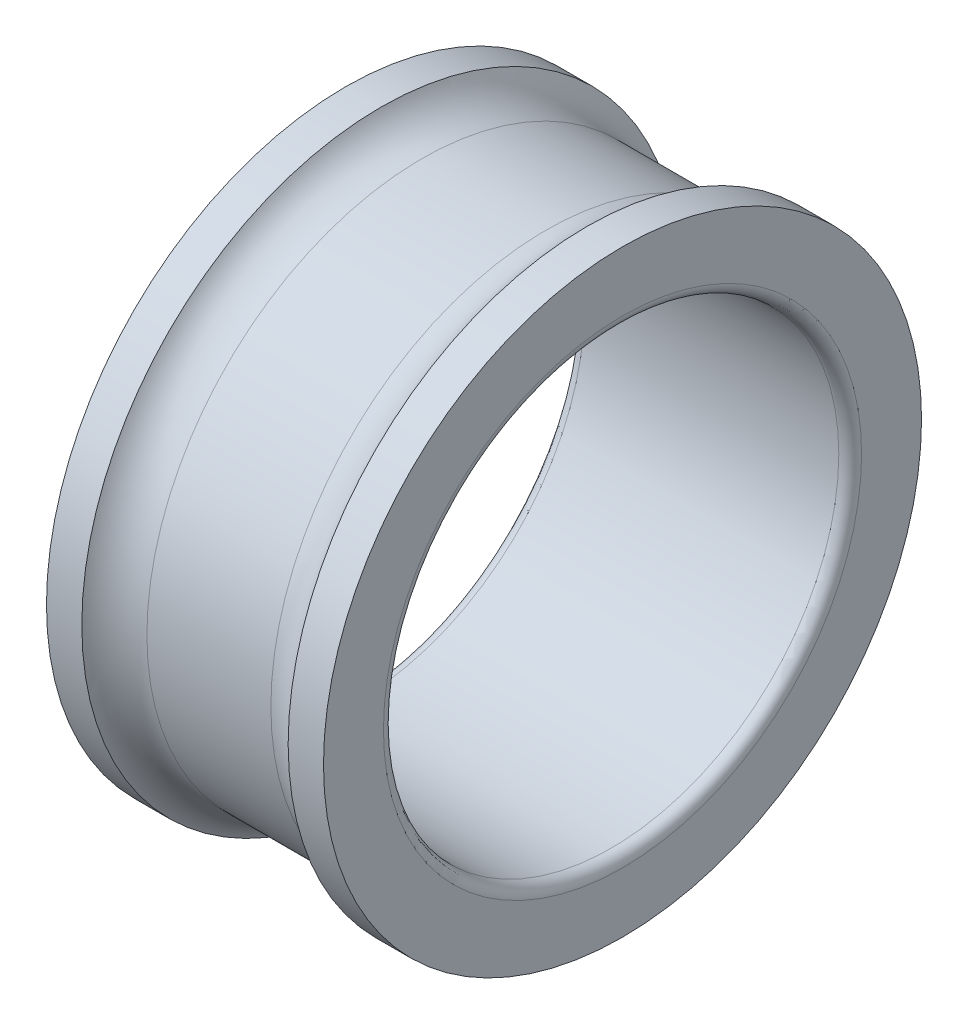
ISO-10303-21;
HEADER;
FILE_DESCRIPTION(('STEP AP214'),'2;1');
FILE_NAME('part.step','',(''),(''),'','','');
FILE_SCHEMA(('AUTOMOTIVE_DESIGN { 1 0 10303 214 1 1 1 1 }'));
ENDSEC;
DATA;
#1=APPLICATION_CONTEXT('core data for automotive mechanical design processes');
#2=APPLICATION_PROTOCOL_DEFINITION('international standard','automotive_design',2000,#1);
#3=PRODUCT_CONTEXT('',#1,'mechanical');
#4=PRODUCT('Part','Part','',(#3));
#5=PRODUCT_RELATED_PRODUCT_CATEGORY('part','',(#4));
#6=PRODUCT_DEFINITION_FORMATION('','',#4);
#7=PRODUCT_DEFINITION_CONTEXT('part definition',#1,'design');
#8=PRODUCT_DEFINITION('design','',#6,#7);
#9=PRODUCT_DEFINITION_SHAPE('','',#8);
#10=(LENGTH_UNIT() NAMED_UNIT(*) SI_UNIT(.MILLI.,.METRE.));
#11=(NAMED_UNIT(*) PLANE_ANGLE_UNIT() SI_UNIT($,.RADIAN.));
#12=(NAMED_UNIT(*) SI_UNIT($,.STERADIAN.) SOLID_ANGLE_UNIT());
#13=UNCERTAINTY_MEASURE_WITH_UNIT(LENGTH_MEASURE(1.E-05),#10,'distance_accuracy_value','');
#14=(GEOMETRIC_REPRESENTATION_CONTEXT(3) GLOBAL_UNCERTAINTY_ASSIGNED_CONTEXT((#13)) GLOBAL_UNIT_ASSIGNED_CONTEXT((#10,
#11,#12)) REPRESENTATION_CONTEXT('',''));
#15=CARTESIAN_POINT('',(0.,0.,0.));
#16=DIRECTION('',(0.,0.,1.));
#17=DIRECTION('',(1.,0.,0.));
#18=AXIS2_PLACEMENT_3D('',#15,#16,#17);
#19=CARTESIAN_POINT('',(-16.75,0.,0.));
#20=DIRECTION('',(-1.,0.,0.));
#21=DIRECTION('',(0.,0.,1.));
#22=AXIS2_PLACEMENT_3D('',#19,#20,#21);
#23=TOROIDAL_SURFACE('',#22,31.5,1.5);
#24=CARTESIAN_POINT('',(-16.75,0.,0.));
#25=DIRECTION('',(-1.,0.,0.));
#26=DIRECTION('',(0.,0.,1.));
#27=AXIS2_PLACEMENT_3D('',#24,#25,#26);
#28=CIRCLE('',#27,30.);
#29=CARTESIAN_POINT('',(-16.75,0.,30.));
#30=VERTEX_POINT('',#29);
#31=EDGE_CURVE('E10',#30,#30,#28,.T.);
#32=ORIENTED_EDGE('',*,*,#31,.F.);
#33=EDGE_LOOP('',(#32));
#34=FACE_BOUND('',#33,.T.);
#35=CARTESIAN_POINT('',(-18.25,0.,0.));
#36=DIRECTION('',(-1.,0.,0.));
#37=DIRECTION('',(0.,0.,1.));
#38=AXIS2_PLACEMENT_3D('',#35,#36,#37);
#39=CIRCLE('',#38,31.5);
#40=CARTESIAN_POINT('',(-18.25,0.,31.5));
#41=VERTEX_POINT('',#40);
#42=EDGE_CURVE('E63',#41,#41,#39,.T.);
#43=ORIENTED_EDGE('',*,*,#42,.T.);
#44=EDGE_LOOP('',(#43));
#45=FACE_BOUND('',#44,.T.);
#46=ADVANCED_FACE('F29',(#34,#45),#23,.T.);
#47=CARTESIAN_POINT('',(0.,0.,0.));
#48=DIRECTION('',(-1.,0.,0.));
#49=DIRECTION('',(0.,0.,1.));
#50=AXIS2_PLACEMENT_3D('',#47,#48,#49);
#51=CYLINDRICAL_SURFACE('',#50,30.);
#52=CARTESIAN_POINT('',(16.75,0.,0.));
#53=DIRECTION('',(-1.,0.,0.));
#54=DIRECTION('',(0.,0.,1.));
#55=AXIS2_PLACEMENT_3D('',#52,#53,#54);
#56=CIRCLE('',#55,30.);
#57=CARTESIAN_POINT('',(16.75,0.,30.));
#58=VERTEX_POINT('',#57);
#59=EDGE_CURVE('E35',#58,#58,#56,.T.);
#60=ORIENTED_EDGE('',*,*,#59,.F.);
#61=EDGE_LOOP('',(#60));
#62=FACE_BOUND('',#61,.T.);
#63=ORIENTED_EDGE('',*,*,#31,.T.);
#64=EDGE_LOOP('',(#63));
#65=FACE_BOUND('',#64,.T.);
#66=ADVANCED_FACE('F112',(#62,#65),#51,.F.);
#67=CARTESIAN_POINT('',(16.75,0.,0.));
#68=DIRECTION('',(-1.,0.,0.));
#69=DIRECTION('',(0.,0.,1.));
#70=AXIS2_PLACEMENT_3D('',#67,#68,#69);
#71=TOROIDAL_SURFACE('',#70,31.5,1.50000000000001);
#72=CARTESIAN_POINT('',(18.25,0.,0.));
#73=DIRECTION('',(-1.,0.,0.));
#74=DIRECTION('',(0.,0.,1.));
#75=AXIS2_PLACEMENT_3D('',#72,#73,#74);
#76=CIRCLE('',#75,31.5);
#77=CARTESIAN_POINT('',(18.25,0.,31.5));
#78=VERTEX_POINT('',#77);
#79=EDGE_CURVE('E39',#78,#78,#76,.T.);
#80=ORIENTED_EDGE('',*,*,#79,.F.);
#81=EDGE_LOOP('',(#80));
#82=FACE_BOUND('',#81,.T.);
#83=ORIENTED_EDGE('',*,*,#59,.T.);
#84=EDGE_LOOP('',(#83));
#85=FACE_BOUND('',#84,.T.);
#86=ADVANCED_FACE('F107',(#82,#85),#71,.T.);
#87=CARTESIAN_POINT('',(18.25,39.4,0.));
#88=DIRECTION('',(-1.,0.,0.));
#89=DIRECTION('',(0.,0.,1.));
#90=AXIS2_PLACEMENT_3D('',#87,#88,#89);
#91=PLANE('',#90);
#92=CARTESIAN_POINT('',(18.25,0.,0.));
#93=DIRECTION('',(-1.,0.,0.));
#94=DIRECTION('',(0.,0.,1.));
#95=AXIS2_PLACEMENT_3D('',#92,#93,#94);
#96=CIRCLE('',#95,39.4);
#97=CARTESIAN_POINT('',(18.25,0.,39.4));
#98=VERTEX_POINT('',#97);
#99=EDGE_CURVE('E43',#98,#98,#96,.T.);
#100=ORIENTED_EDGE('',*,*,#99,.F.);
#101=EDGE_LOOP('',(#100));
#102=FACE_BOUND('',#101,.T.);
#103=ORIENTED_EDGE('',*,*,#79,.T.);
#104=EDGE_LOOP('',(#103));
#105=FACE_BOUND('',#104,.T.);
#106=ADVANCED_FACE('F101',(#102,#105),#91,.F.);
#107=CARTESIAN_POINT('',(0.,0.,0.));
#108=DIRECTION('',(-1.,0.,0.));
#109=DIRECTION('',(0.,0.,1.));
#110=AXIS2_PLACEMENT_3D('',#107,#108,#109);
#111=CYLINDRICAL_SURFACE('',#110,39.4);
#112=CARTESIAN_POINT('',(13.5936824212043,0.,0.));
#113=DIRECTION('',(-1.,0.,0.));
#114=DIRECTION('',(0.,0.,1.));
#115=AXIS2_PLACEMENT_3D('',#112,#113,#114);
#116=CIRCLE('',#115,39.4);
#117=CARTESIAN_POINT('',(13.5936824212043,0.,39.4));
#118=VERTEX_POINT('',#117);
#119=EDGE_CURVE('E48',#118,#118,#116,.T.);
#120=ORIENTED_EDGE('',*,*,#119,.F.);
#121=EDGE_LOOP('',(#120));
#122=FACE_BOUND('',#121,.T.);
#123=ORIENTED_EDGE('',*,*,#99,.T.);
#124=EDGE_LOOP('',(#123));
#125=FACE_BOUND('',#124,.T.);
#126=ADVANCED_FACE('F95',(#122,#125),#111,.T.);
#127=CARTESIAN_POINT('',(8.16666666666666,0.,0.));
#128=DIRECTION('',(-1.,0.,0.));
#129=DIRECTION('',(0.,0.,1.));
#130=AXIS2_PLACEMENT_3D('',#127,#128,#129);
#131=TOROIDAL_SURFACE('',#130,42.5,6.25);
#132=CARTESIAN_POINT('',(8.16666666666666,0.,0.));
#133=DIRECTION('',(-1.,0.,0.));
#134=DIRECTION('',(0.,0.,1.));
#135=AXIS2_PLACEMENT_3D('',#132,#133,#134);
#136=CIRCLE('',#135,36.25);
#137=CARTESIAN_POINT('',(8.16666666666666,0.,36.25));
#138=VERTEX_POINT('',#137);
#139=EDGE_CURVE('E51',#138,#138,#136,.T.);
#140=ORIENTED_EDGE('',*,*,#139,.F.);
#141=EDGE_LOOP('',(#140));
#142=FACE_BOUND('',#141,.T.);
#143=ORIENTED_EDGE('',*,*,#119,.T.);
#144=EDGE_LOOP('',(#143));
#145=FACE_BOUND('',#144,.T.);
#146=ADVANCED_FACE('F89',(#142,#145),#131,.F.);
#147=CARTESIAN_POINT('',(0.,0.,0.));
#148=DIRECTION('',(-1.,0.,0.));
#149=DIRECTION('',(0.,0.,1.));
#150=AXIS2_PLACEMENT_3D('',#147,#148,#149);
#151=CYLINDRICAL_SURFACE('',#150,36.25);
#152=CARTESIAN_POINT('',(-8.16666666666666,0.,0.));
#153=DIRECTION('',(-1.,0.,0.));
#154=DIRECTION('',(0.,0.,1.));
#155=AXIS2_PLACEMENT_3D('',#152,#153,#154);
#156=CIRCLE('',#155,36.25);
#157=CARTESIAN_POINT('',(-8.16666666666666,0.,36.25));
#158=VERTEX_POINT('',#157);
#159=EDGE_CURVE('E54',#158,#158,#156,.T.);
#160=ORIENTED_EDGE('',*,*,#159,.F.);
#161=EDGE_LOOP('',(#160));
#162=FACE_BOUND('',#161,.T.);
#163=ORIENTED_EDGE('',*,*,#139,.T.);
#164=EDGE_LOOP('',(#163));
#165=FACE_BOUND('',#164,.T.);
#166=ADVANCED_FACE('F83',(#162,#165),#151,.T.);
#167=CARTESIAN_POINT('',(-8.16666666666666,0.,0.));
#168=DIRECTION('',(-1.,0.,0.));
#169=DIRECTION('',(0.,0.,1.));
#170=AXIS2_PLACEMENT_3D('',#167,#168,#169);
#171=TOROIDAL_SURFACE('',#170,42.5,6.25);
#172=CARTESIAN_POINT('',(-13.5936824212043,0.,0.));
#173=DIRECTION('',(-1.,0.,0.));
#174=DIRECTION('',(0.,0.,1.));
#175=AXIS2_PLACEMENT_3D('',#172,#173,#174);
#176=CIRCLE('',#175,39.4);
#177=CARTESIAN_POINT('',(-13.5936824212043,0.,39.4));
#178=VERTEX_POINT('',#177);
#179=EDGE_CURVE('E57',#178,#178,#176,.T.);
#180=ORIENTED_EDGE('',*,*,#179,.F.);
#181=EDGE_LOOP('',(#180));
#182=FACE_BOUND('',#181,.T.);
#183=ORIENTED_EDGE('',*,*,#159,.T.);
#184=EDGE_LOOP('',(#183));
#185=FACE_BOUND('',#184,.T.);
#186=ADVANCED_FACE('F77',(#182,#185),#171,.F.);
#187=CARTESIAN_POINT('',(0.,0.,0.));
#188=DIRECTION('',(-1.,0.,0.));
#189=DIRECTION('',(0.,0.,1.));
#190=AXIS2_PLACEMENT_3D('',#187,#188,#189);
#191=CYLINDRICAL_SURFACE('',#190,39.4);
#192=CARTESIAN_POINT('',(-18.25,0.,0.));
#193=DIRECTION('',(-1.,0.,0.));
#194=DIRECTION('',(0.,0.,1.));
#195=AXIS2_PLACEMENT_3D('',#192,#193,#194);
#196=CIRCLE('',#195,39.4);
#197=CARTESIAN_POINT('',(-18.25,0.,39.4));
#198=VERTEX_POINT('',#197);
#199=EDGE_CURVE('E60',#198,#198,#196,.T.);
#200=ORIENTED_EDGE('',*,*,#199,.F.);
#201=EDGE_LOOP('',(#200));
#202=FACE_BOUND('',#201,.T.);
#203=ORIENTED_EDGE('',*,*,#179,.T.);
#204=EDGE_LOOP('',(#203));
#205=FACE_BOUND('',#204,.T.);
#206=ADVANCED_FACE('F71',(#202,#205),#191,.T.);
#207=CARTESIAN_POINT('',(-18.25,39.4,0.));
#208=DIRECTION('',(1.,0.,0.));
#209=DIRECTION('',(0.,0.,-1.));
#210=AXIS2_PLACEMENT_3D('',#207,#208,#209);
#211=PLANE('',#210);
#212=ORIENTED_EDGE('',*,*,#42,.F.);
#213=EDGE_LOOP('',(#212));
#214=FACE_BOUND('',#213,.T.);
#215=ORIENTED_EDGE('',*,*,#199,.T.);
#216=EDGE_LOOP('',(#215));
#217=FACE_BOUND('',#216,.T.);
#218=ADVANCED_FACE('F68',(#214,#217),#211,.F.);
#219=CLOSED_SHELL('',(#46,#66,#86,#106,#126,#146,#166,#186,#206,#218));
#220=MANIFOLD_SOLID_BREP('B2',#219);
#221=ADVANCED_BREP_SHAPE_REPRESENTATION('',(#18,#220),#14);
#222=SHAPE_DEFINITION_REPRESENTATION(#9,#221);
ENDSEC;
END-ISO-10303-21;
